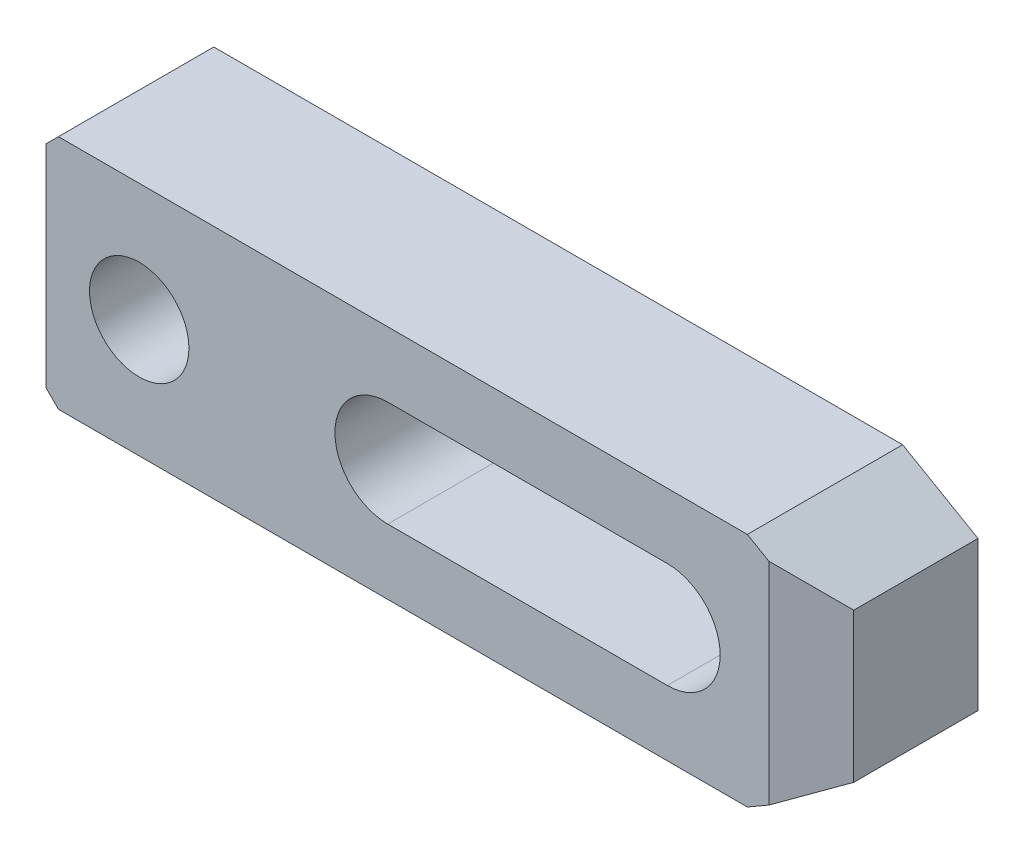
ISO-10303-21;
HEADER;
FILE_DESCRIPTION(('STEP AP214'),'2;1');
FILE_NAME('part.step','',(''),(''),'','','');
FILE_SCHEMA(('AUTOMOTIVE_DESIGN { 1 0 10303 214 1 1 1 1 }'));
ENDSEC;
DATA;
#1=APPLICATION_CONTEXT('core data for automotive mechanical design processes');
#2=APPLICATION_PROTOCOL_DEFINITION('international standard','automotive_design',2000,#1);
#3=PRODUCT_CONTEXT('',#1,'mechanical');
#4=PRODUCT('Part','Part','',(#3));
#5=PRODUCT_RELATED_PRODUCT_CATEGORY('part','',(#4));
#6=PRODUCT_DEFINITION_FORMATION('','',#4);
#7=PRODUCT_DEFINITION_CONTEXT('part definition',#1,'design');
#8=PRODUCT_DEFINITION('design','',#6,#7);
#9=PRODUCT_DEFINITION_SHAPE('','',#8);
#10=(LENGTH_UNIT() NAMED_UNIT(*) SI_UNIT(.MILLI.,.METRE.));
#11=(NAMED_UNIT(*) PLANE_ANGLE_UNIT() SI_UNIT($,.RADIAN.));
#12=(NAMED_UNIT(*) SI_UNIT($,.STERADIAN.) SOLID_ANGLE_UNIT());
#13=UNCERTAINTY_MEASURE_WITH_UNIT(LENGTH_MEASURE(1.E-05),#10,'distance_accuracy_value','');
#14=(GEOMETRIC_REPRESENTATION_CONTEXT(3) GLOBAL_UNCERTAINTY_ASSIGNED_CONTEXT((#13)) GLOBAL_UNIT_ASSIGNED_CONTEXT((#10,
#11,#12)) REPRESENTATION_CONTEXT('',''));
#15=CARTESIAN_POINT('',(0.,0.,0.));
#16=DIRECTION('',(0.,0.,1.));
#17=DIRECTION('',(1.,0.,0.));
#18=AXIS2_PLACEMENT_3D('',#15,#16,#17);
#19=CARTESIAN_POINT('',(-57.4166975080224,59.5833024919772,0.));
#20=DIRECTION('',(0.,0.,1.));
#21=DIRECTION('',(-1.,0.,0.));
#22=AXIS2_PLACEMENT_3D('',#19,#20,#21);
#23=PLANE('',#22);
#24=DIRECTION('',(0.,1.,0.));
#25=VECTOR('',#24,1.);
#26=CARTESIAN_POINT('',(-100.,-17.,0.));
#27=LINE('',#26,#25);
#28=CARTESIAN_POINT('',(-100.,-17.,0.));
#29=VERTEX_POINT('',#28);
#30=CARTESIAN_POINT('',(-100.,-8.5,0.));
#31=VERTEX_POINT('',#30);
#32=EDGE_CURVE('E147',#29,#31,#27,.T.);
#33=ORIENTED_EDGE('',*,*,#32,.T.);
#34=DIRECTION('',(-1.,0.,0.));
#35=VECTOR('',#34,1.);
#36=CARTESIAN_POINT('',(0.,-8.5,0.));
#37=LINE('',#36,#35);
#38=CARTESIAN_POINT('',(0.,-8.5,0.));
#39=VERTEX_POINT('',#38);
#40=EDGE_CURVE('E237',#39,#31,#37,.T.);
#41=ORIENTED_EDGE('',*,*,#40,.F.);
#42=CARTESIAN_POINT('',(0.,0.,0.));
#43=DIRECTION('',(0.,0.,1.));
#44=DIRECTION('',(-1.,0.,0.));
#45=AXIS2_PLACEMENT_3D('',#42,#43,#44);
#46=CIRCLE('',#45,8.5);
#47=CARTESIAN_POINT('',(0.,8.5,0.));
#48=VERTEX_POINT('',#47);
#49=EDGE_CURVE('E128',#39,#48,#46,.T.);
#50=ORIENTED_EDGE('',*,*,#49,.T.);
#51=DIRECTION('',(1.,0.,0.));
#52=VECTOR('',#51,1.);
#53=CARTESIAN_POINT('',(-45.,8.5,0.));
#54=LINE('',#53,#52);
#55=CARTESIAN_POINT('',(-100.,8.5,0.));
#56=VERTEX_POINT('',#55);
#57=EDGE_CURVE('E119',#56,#48,#54,.T.);
#58=ORIENTED_EDGE('',*,*,#57,.F.);
#59=CARTESIAN_POINT('',(-100.,17.,0.));
#60=VERTEX_POINT('',#59);
#61=EDGE_CURVE('E124',#56,#60,#27,.T.);
#62=ORIENTED_EDGE('',*,*,#61,.T.);
#63=DIRECTION('',(-0.707106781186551,-0.707106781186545,0.));
#64=VECTOR('',#63,1.);
#65=CARTESIAN_POINT('',(-98.,19.,0.));
#66=LINE('',#65,#64);
#67=CARTESIAN_POINT('',(-98.,19.,0.));
#68=VERTEX_POINT('',#67);
#69=EDGE_CURVE('E148',#68,#60,#66,.T.);
#70=ORIENTED_EDGE('',*,*,#69,.F.);
#71=DIRECTION('',(-1.,0.,0.));
#72=VECTOR('',#71,1.);
#73=CARTESIAN_POINT('',(12.875644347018,19.,0.));
#74=LINE('',#73,#72);
#75=CARTESIAN_POINT('',(12.875644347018,19.,0.));
#76=VERTEX_POINT('',#75);
#77=EDGE_CURVE('E151',#76,#68,#74,.T.);
#78=ORIENTED_EDGE('',*,*,#77,.F.);
#79=DIRECTION('',(-0.866025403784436,0.5,0.));
#80=VECTOR('',#79,1.);
#81=CARTESIAN_POINT('',(25.,12.,0.));
#82=LINE('',#81,#80);
#83=CARTESIAN_POINT('',(25.,12.,0.));
#84=VERTEX_POINT('',#83);
#85=EDGE_CURVE('E158',#84,#76,#82,.T.);
#86=ORIENTED_EDGE('',*,*,#85,.F.);
#87=DIRECTION('',(0.,-1.,0.));
#88=VECTOR('',#87,1.);
#89=CARTESIAN_POINT('',(25.,12.,0.));
#90=LINE('',#89,#88);
#91=CARTESIAN_POINT('',(25.,-12.,0.));
#92=VERTEX_POINT('',#91);
#93=EDGE_CURVE('E181',#84,#92,#90,.T.);
#94=ORIENTED_EDGE('',*,*,#93,.T.);
#95=DIRECTION('',(-0.86602540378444,-0.5,0.));
#96=VECTOR('',#95,1.);
#97=CARTESIAN_POINT('',(25.,-12.,0.));
#98=LINE('',#97,#96);
#99=CARTESIAN_POINT('',(12.8756443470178,-19.,0.));
#100=VERTEX_POINT('',#99);
#101=EDGE_CURVE('E208',#92,#100,#98,.T.);
#102=ORIENTED_EDGE('',*,*,#101,.T.);
#103=DIRECTION('',(-1.,0.,0.));
#104=VECTOR('',#103,1.);
#105=CARTESIAN_POINT('',(12.8756443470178,-19.,0.));
#106=LINE('',#105,#104);
#107=CARTESIAN_POINT('',(-98.,-19.,0.));
#108=VERTEX_POINT('',#107);
#109=EDGE_CURVE('E210',#100,#108,#106,.T.);
#110=ORIENTED_EDGE('',*,*,#109,.T.);
#111=DIRECTION('',(-0.707106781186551,0.707106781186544,0.));
#112=VECTOR('',#111,1.);
#113=CARTESIAN_POINT('',(-98.,-19.,0.));
#114=LINE('',#113,#112);
#115=EDGE_CURVE('E150',#108,#29,#114,.T.);
#116=ORIENTED_EDGE('',*,*,#115,.T.);
#117=EDGE_LOOP('',(#33,#41,#50,#58,#62,#70,#78,#86,#94,#102,#110,#116));
#118=FACE_BOUND('',#117,.T.);
#119=ADVANCED_FACE('F14',(#118),#23,.F.);
#120=CARTESIAN_POINT('',(-100.,-17.,25.));
#121=DIRECTION('',(-1.,0.,0.));
#122=DIRECTION('',(0.,0.,-1.));
#123=AXIS2_PLACEMENT_3D('',#120,#121,#122);
#124=PLANE('',#123);
#125=DIRECTION('',(0.,-1.,0.));
#126=VECTOR('',#125,1.);
#127=CARTESIAN_POINT('',(-100.,-17.,5.));
#128=LINE('',#127,#126);
#129=CARTESIAN_POINT('',(-100.,8.5,5.));
#130=VERTEX_POINT('',#129);
#131=CARTESIAN_POINT('',(-100.,-8.5,5.));
#132=VERTEX_POINT('',#131);
#133=EDGE_CURVE('E141',#130,#132,#128,.T.);
#134=ORIENTED_EDGE('',*,*,#133,.T.);
#135=DIRECTION('',(0.,0.,-1.));
#136=VECTOR('',#135,1.);
#137=CARTESIAN_POINT('',(-100.,-8.5,25.));
#138=LINE('',#137,#136);
#139=EDGE_CURVE('E140',#132,#31,#138,.T.);
#140=ORIENTED_EDGE('',*,*,#139,.T.);
#141=ORIENTED_EDGE('',*,*,#32,.F.);
#142=DIRECTION('',(0.,0.,-1.));
#143=VECTOR('',#142,1.);
#144=CARTESIAN_POINT('',(-100.,-17.,25.));
#145=LINE('',#144,#143);
#146=CARTESIAN_POINT('',(-100.,-17.,25.));
#147=VERTEX_POINT('',#146);
#148=EDGE_CURVE('E189',#147,#29,#145,.T.);
#149=ORIENTED_EDGE('',*,*,#148,.F.);
#150=DIRECTION('',(0.,1.,0.));
#151=VECTOR('',#150,1.);
#152=CARTESIAN_POINT('',(-100.,-17.,25.));
#153=LINE('',#152,#151);
#154=CARTESIAN_POINT('',(-100.,17.,25.));
#155=VERTEX_POINT('',#154);
#156=EDGE_CURVE('E171',#147,#155,#153,.T.);
#157=ORIENTED_EDGE('',*,*,#156,.T.);
#158=DIRECTION('',(0.,0.,-1.));
#159=VECTOR('',#158,1.);
#160=CARTESIAN_POINT('',(-100.,17.,25.));
#161=LINE('',#160,#159);
#162=EDGE_CURVE('E145',#155,#60,#161,.T.);
#163=ORIENTED_EDGE('',*,*,#162,.T.);
#164=ORIENTED_EDGE('',*,*,#61,.F.);
#165=DIRECTION('',(0.,0.,-1.));
#166=VECTOR('',#165,1.);
#167=CARTESIAN_POINT('',(-100.,8.5,25.));
#168=LINE('',#167,#166);
#169=EDGE_CURVE('E135',#130,#56,#168,.T.);
#170=ORIENTED_EDGE('',*,*,#169,.F.);
#171=EDGE_LOOP('',(#134,#140,#141,#149,#157,#163,#164,#170));
#172=FACE_BOUND('',#171,.T.);
#173=ADVANCED_FACE('F143',(#172),#124,.T.);
#174=CARTESIAN_POINT('',(-85.,0.,25.));
#175=DIRECTION('',(0.,0.,-1.));
#176=DIRECTION('',(1.,0.,0.));
#177=AXIS2_PLACEMENT_3D('',#174,#175,#176);
#178=CYLINDRICAL_SURFACE('',#177,8.);
#179=CARTESIAN_POINT('',(-85.,0.,25.));
#180=DIRECTION('',(0.,0.,1.));
#181=DIRECTION('',(-1.,0.,0.));
#182=AXIS2_PLACEMENT_3D('',#179,#180,#181);
#183=CIRCLE('',#182,8.);
#184=CARTESIAN_POINT('',(-93.,0.,25.));
#185=VERTEX_POINT('',#184);
#186=EDGE_CURVE('E161',#185,#185,#183,.T.);
#187=ORIENTED_EDGE('',*,*,#186,.T.);
#188=EDGE_LOOP('',(#187));
#189=FACE_BOUND('',#188,.T.);
#190=CARTESIAN_POINT('',(-85.,0.,5.));
#191=DIRECTION('',(0.,0.,-1.));
#192=DIRECTION('',(1.,0.,0.));
#193=AXIS2_PLACEMENT_3D('',#190,#191,#192);
#194=CIRCLE('',#193,8.);
#195=CARTESIAN_POINT('',(-77.,0.,5.));
#196=VERTEX_POINT('',#195);
#197=EDGE_CURVE('E425',#196,#196,#194,.T.);
#198=ORIENTED_EDGE('',*,*,#197,.T.);
#199=EDGE_LOOP('',(#198));
#200=FACE_BOUND('',#199,.T.);
#201=ADVANCED_FACE('F262',(#189,#200),#178,.F.);
#202=CARTESIAN_POINT('',(-45.,0.,25.));
#203=DIRECTION('',(0.,0.,-1.));
#204=DIRECTION('',(1.,0.,0.));
#205=AXIS2_PLACEMENT_3D('',#202,#203,#204);
#206=CYLINDRICAL_SURFACE('',#205,8.5);
#207=DIRECTION('',(0.,0.,-1.));
#208=VECTOR('',#207,1.);
#209=CARTESIAN_POINT('',(-45.,-8.5,25.));
#210=LINE('',#209,#208);
#211=CARTESIAN_POINT('',(-45.,-8.5,25.));
#212=VERTEX_POINT('',#211);
#213=CARTESIAN_POINT('',(-45.,-8.5,5.));
#214=VERTEX_POINT('',#213);
#215=EDGE_CURVE('E256',#212,#214,#210,.T.);
#216=ORIENTED_EDGE('',*,*,#215,.T.);
#217=CARTESIAN_POINT('',(-45.,0.,5.));
#218=DIRECTION('',(0.,0.,-1.));
#219=DIRECTION('',(1.,0.,0.));
#220=AXIS2_PLACEMENT_3D('',#217,#218,#219);
#221=CIRCLE('',#220,8.5);
#222=CARTESIAN_POINT('',(-45.,8.5,5.));
#223=VERTEX_POINT('',#222);
#224=EDGE_CURVE('E278',#214,#223,#221,.T.);
#225=ORIENTED_EDGE('',*,*,#224,.T.);
#226=DIRECTION('',(0.,0.,-1.));
#227=VECTOR('',#226,1.);
#228=CARTESIAN_POINT('',(-45.,8.5,25.));
#229=LINE('',#228,#227);
#230=CARTESIAN_POINT('',(-45.,8.5,25.));
#231=VERTEX_POINT('',#230);
#232=EDGE_CURVE('E244',#231,#223,#229,.T.);
#233=ORIENTED_EDGE('',*,*,#232,.F.);
#234=CARTESIAN_POINT('',(-45.,0.,25.));
#235=DIRECTION('',(0.,0.,1.));
#236=DIRECTION('',(-1.,0.,0.));
#237=AXIS2_PLACEMENT_3D('',#234,#235,#236);
#238=CIRCLE('',#237,8.5);
#239=EDGE_CURVE('E132',#231,#212,#238,.T.);
#240=ORIENTED_EDGE('',*,*,#239,.T.);
#241=EDGE_LOOP('',(#216,#225,#233,#240));
#242=FACE_BOUND('',#241,.T.);
#243=ADVANCED_FACE('F269',(#242),#206,.F.);
#244=CARTESIAN_POINT('',(-57.4166975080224,59.5833024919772,25.));
#245=DIRECTION('',(0.,0.,1.));
#246=DIRECTION('',(-1.,0.,0.));
#247=AXIS2_PLACEMENT_3D('',#244,#245,#246);
#248=PLANE('',#247);
#249=DIRECTION('',(0.,-1.,0.));
#250=VECTOR('',#249,1.);
#251=CARTESIAN_POINT('',(16.3397459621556,59.5833024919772,25.));
#252=LINE('',#251,#250);
#253=CARTESIAN_POINT('',(16.3397459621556,17.,25.));
#254=VERTEX_POINT('',#253);
#255=CARTESIAN_POINT('',(16.3397459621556,-17.,25.));
#256=VERTEX_POINT('',#255);
#257=EDGE_CURVE('E233',#254,#256,#252,.T.);
#258=ORIENTED_EDGE('',*,*,#257,.F.);
#259=DIRECTION('',(-0.866025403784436,0.5,0.));
#260=VECTOR('',#259,1.);
#261=CARTESIAN_POINT('',(25.,12.,25.));
#262=LINE('',#261,#260);
#263=CARTESIAN_POINT('',(12.875644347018,19.,25.));
#264=VERTEX_POINT('',#263);
#265=EDGE_CURVE('E179',#254,#264,#262,.T.);
#266=ORIENTED_EDGE('',*,*,#265,.T.);
#267=DIRECTION('',(-1.,0.,0.));
#268=VECTOR('',#267,1.);
#269=CARTESIAN_POINT('',(12.875644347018,19.,25.));
#270=LINE('',#269,#268);
#271=CARTESIAN_POINT('',(-98.,19.,25.));
#272=VERTEX_POINT('',#271);
#273=EDGE_CURVE('E176',#264,#272,#270,.T.);
#274=ORIENTED_EDGE('',*,*,#273,.T.);
#275=DIRECTION('',(-0.707106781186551,-0.707106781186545,0.));
#276=VECTOR('',#275,1.);
#277=CARTESIAN_POINT('',(-98.,19.,25.));
#278=LINE('',#277,#276);
#279=EDGE_CURVE('E173',#272,#155,#278,.T.);
#280=ORIENTED_EDGE('',*,*,#279,.T.);
#281=ORIENTED_EDGE('',*,*,#156,.F.);
#282=DIRECTION('',(-0.707106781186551,0.707106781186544,0.));
#283=VECTOR('',#282,1.);
#284=CARTESIAN_POINT('',(-98.,-19.,25.));
#285=LINE('',#284,#283);
#286=CARTESIAN_POINT('',(-98.,-19.,25.));
#287=VERTEX_POINT('',#286);
#288=EDGE_CURVE('E168',#287,#147,#285,.T.);
#289=ORIENTED_EDGE('',*,*,#288,.F.);
#290=DIRECTION('',(-1.,0.,0.));
#291=VECTOR('',#290,1.);
#292=CARTESIAN_POINT('',(12.8756443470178,-19.,25.));
#293=LINE('',#292,#291);
#294=CARTESIAN_POINT('',(12.8756443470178,-19.,25.));
#295=VERTEX_POINT('',#294);
#296=EDGE_CURVE('E165',#295,#287,#293,.T.);
#297=ORIENTED_EDGE('',*,*,#296,.F.);
#298=DIRECTION('',(-0.86602540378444,-0.5,0.));
#299=VECTOR('',#298,1.);
#300=CARTESIAN_POINT('',(25.,-12.,25.));
#301=LINE('',#300,#299);
#302=EDGE_CURVE('E162',#256,#295,#301,.T.);
#303=ORIENTED_EDGE('',*,*,#302,.F.);
#304=EDGE_LOOP('',(#258,#266,#274,#280,#281,#289,#297,#303));
#305=FACE_BOUND('',#304,.T.);
#306=ORIENTED_EDGE('',*,*,#186,.F.);
#307=EDGE_LOOP('',(#306));
#308=FACE_BOUND('',#307,.T.);
#309=DIRECTION('',(-1.,0.,0.));
#310=VECTOR('',#309,1.);
#311=CARTESIAN_POINT('',(0.,-8.5,25.));
#312=LINE('',#311,#310);
#313=CARTESIAN_POINT('',(0.,-8.5,25.));
#314=VERTEX_POINT('',#313);
#315=EDGE_CURVE('E247',#314,#212,#312,.T.);
#316=ORIENTED_EDGE('',*,*,#315,.T.);
#317=ORIENTED_EDGE('',*,*,#239,.F.);
#318=DIRECTION('',(1.,0.,0.));
#319=VECTOR('',#318,1.);
#320=CARTESIAN_POINT('',(-45.,8.5,25.));
#321=LINE('',#320,#319);
#322=CARTESIAN_POINT('',(0.,8.5,25.));
#323=VERTEX_POINT('',#322);
#324=EDGE_CURVE('E241',#231,#323,#321,.T.);
#325=ORIENTED_EDGE('',*,*,#324,.T.);
#326=CARTESIAN_POINT('',(0.,0.,25.));
#327=DIRECTION('',(0.,0.,1.));
#328=DIRECTION('',(-1.,0.,0.));
#329=AXIS2_PLACEMENT_3D('',#326,#327,#328);
#330=CIRCLE('',#329,8.5);
#331=EDGE_CURVE('E245',#314,#323,#330,.T.);
#332=ORIENTED_EDGE('',*,*,#331,.F.);
#333=EDGE_LOOP('',(#316,#317,#325,#332));
#334=FACE_BOUND('',#333,.T.);
#335=ADVANCED_FACE('F265',(#305,#308,#334),#248,.T.);
#336=CARTESIAN_POINT('',(25.,12.,25.));
#337=DIRECTION('',(-0.5,-0.866025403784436,0.));
#338=DIRECTION('',(0.866025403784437,-0.5,0.));
#339=AXIS2_PLACEMENT_3D('',#336,#337,#338);
#340=PLANE('',#339);
#341=ORIENTED_EDGE('',*,*,#265,.F.);
#342=DIRECTION('',(0.774596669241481,-0.447213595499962,-0.447213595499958));
#343=VECTOR('',#342,1.);
#344=CARTESIAN_POINT('',(23.2679491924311,13.,21.));
#345=LINE('',#344,#343);
#346=CARTESIAN_POINT('',(25.,12.,20.));
#347=VERTEX_POINT('',#346);
#348=EDGE_CURVE('E235',#254,#347,#345,.T.);
#349=ORIENTED_EDGE('',*,*,#348,.T.);
#350=DIRECTION('',(0.,0.,-1.));
#351=VECTOR('',#350,1.);
#352=CARTESIAN_POINT('',(25.,12.,25.));
#353=LINE('',#352,#351);
#354=EDGE_CURVE('E164',#347,#84,#353,.T.);
#355=ORIENTED_EDGE('',*,*,#354,.T.);
#356=ORIENTED_EDGE('',*,*,#85,.T.);
#357=DIRECTION('',(0.,0.,-1.));
#358=VECTOR('',#357,1.);
#359=CARTESIAN_POINT('',(12.875644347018,19.,25.));
#360=LINE('',#359,#358);
#361=EDGE_CURVE('E9',#264,#76,#360,.T.);
#362=ORIENTED_EDGE('',*,*,#361,.F.);
#363=EDGE_LOOP('',(#341,#349,#355,#356,#362));
#364=FACE_BOUND('',#363,.T.);
#365=ADVANCED_FACE('F268',(#364),#340,.F.);
#366=CARTESIAN_POINT('',(12.875644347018,19.,25.));
#367=DIRECTION('',(0.,-1.,0.));
#368=DIRECTION('',(0.,0.,1.));
#369=AXIS2_PLACEMENT_3D('',#366,#367,#368);
#370=PLANE('',#369);
#371=DIRECTION('',(0.,0.,-1.));
#372=VECTOR('',#371,1.);
#373=CARTESIAN_POINT('',(-98.,19.,25.));
#374=LINE('',#373,#372);
#375=EDGE_CURVE('E22',#272,#68,#374,.T.);
#376=ORIENTED_EDGE('',*,*,#375,.F.);
#377=ORIENTED_EDGE('',*,*,#273,.F.);
#378=ORIENTED_EDGE('',*,*,#361,.T.);
#379=ORIENTED_EDGE('',*,*,#77,.T.);
#380=EDGE_LOOP('',(#376,#377,#378,#379));
#381=FACE_BOUND('',#380,.T.);
#382=ADVANCED_FACE('F16',(#381),#370,.F.);
#383=CARTESIAN_POINT('',(-98.,19.,25.));
#384=DIRECTION('',(0.707106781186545,-0.707106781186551,0.));
#385=DIRECTION('',(0.707106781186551,0.707106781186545,0.));
#386=AXIS2_PLACEMENT_3D('',#383,#384,#385);
#387=PLANE('',#386);
#388=ORIENTED_EDGE('',*,*,#162,.F.);
#389=ORIENTED_EDGE('',*,*,#279,.F.);
#390=ORIENTED_EDGE('',*,*,#375,.T.);
#391=ORIENTED_EDGE('',*,*,#69,.T.);
#392=EDGE_LOOP('',(#388,#389,#390,#391));
#393=FACE_BOUND('',#392,.T.);
#394=ADVANCED_FACE('F193',(#393),#387,.F.);
#395=CARTESIAN_POINT('',(-98.,-19.,25.));
#396=DIRECTION('',(-0.707106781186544,-0.707106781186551,0.));
#397=DIRECTION('',(0.707106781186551,-0.707106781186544,0.));
#398=AXIS2_PLACEMENT_3D('',#395,#396,#397);
#399=PLANE('',#398);
#400=DIRECTION('',(0.,0.,-1.));
#401=VECTOR('',#400,1.);
#402=CARTESIAN_POINT('',(-98.,-19.,25.));
#403=LINE('',#402,#401);
#404=EDGE_CURVE('E187',#287,#108,#403,.T.);
#405=ORIENTED_EDGE('',*,*,#404,.F.);
#406=ORIENTED_EDGE('',*,*,#288,.T.);
#407=ORIENTED_EDGE('',*,*,#148,.T.);
#408=ORIENTED_EDGE('',*,*,#115,.F.);
#409=EDGE_LOOP('',(#405,#406,#407,#408));
#410=FACE_BOUND('',#409,.T.);
#411=ADVANCED_FACE('F220',(#410),#399,.T.);
#412=CARTESIAN_POINT('',(12.8756443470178,-19.,25.));
#413=DIRECTION('',(0.,-1.,0.));
#414=DIRECTION('',(0.,0.,1.));
#415=AXIS2_PLACEMENT_3D('',#412,#413,#414);
#416=PLANE('',#415);
#417=DIRECTION('',(0.,0.,-1.));
#418=VECTOR('',#417,1.);
#419=CARTESIAN_POINT('',(12.8756443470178,-19.,25.));
#420=LINE('',#419,#418);
#421=EDGE_CURVE('E185',#295,#100,#420,.T.);
#422=ORIENTED_EDGE('',*,*,#421,.F.);
#423=ORIENTED_EDGE('',*,*,#296,.T.);
#424=ORIENTED_EDGE('',*,*,#404,.T.);
#425=ORIENTED_EDGE('',*,*,#109,.F.);
#426=EDGE_LOOP('',(#422,#423,#424,#425));
#427=FACE_BOUND('',#426,.T.);
#428=ADVANCED_FACE('F306',(#427),#416,.T.);
#429=CARTESIAN_POINT('',(25.,-12.,25.));
#430=DIRECTION('',(0.5,-0.86602540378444,0.));
#431=DIRECTION('',(0.86602540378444,0.5,0.));
#432=AXIS2_PLACEMENT_3D('',#429,#430,#431);
#433=PLANE('',#432);
#434=DIRECTION('',(0.774596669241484,0.447213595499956,-0.44721359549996));
#435=VECTOR('',#434,1.);
#436=CARTESIAN_POINT('',(23.2679491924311,-13.,21.));
#437=LINE('',#436,#435);
#438=CARTESIAN_POINT('',(25.,-12.,20.));
#439=VERTEX_POINT('',#438);
#440=EDGE_CURVE('E37',#256,#439,#437,.T.);
#441=ORIENTED_EDGE('',*,*,#440,.F.);
#442=ORIENTED_EDGE('',*,*,#302,.T.);
#443=ORIENTED_EDGE('',*,*,#421,.T.);
#444=ORIENTED_EDGE('',*,*,#101,.F.);
#445=DIRECTION('',(0.,0.,-1.));
#446=VECTOR('',#445,1.);
#447=CARTESIAN_POINT('',(25.,-12.,25.));
#448=LINE('',#447,#446);
#449=EDGE_CURVE('E183',#439,#92,#448,.T.);
#450=ORIENTED_EDGE('',*,*,#449,.F.);
#451=EDGE_LOOP('',(#441,#442,#443,#444,#450));
#452=FACE_BOUND('',#451,.T.);
#453=ADVANCED_FACE('F303',(#452),#433,.T.);
#454=CARTESIAN_POINT('',(25.,12.,25.));
#455=DIRECTION('',(1.,0.,0.));
#456=DIRECTION('',(0.,0.,1.));
#457=AXIS2_PLACEMENT_3D('',#454,#455,#456);
#458=PLANE('',#457);
#459=DIRECTION('',(0.,-1.,0.));
#460=VECTOR('',#459,1.);
#461=CARTESIAN_POINT('',(25.,20.,20.));
#462=LINE('',#461,#460);
#463=EDGE_CURVE('E227',#347,#439,#462,.T.);
#464=ORIENTED_EDGE('',*,*,#463,.T.);
#465=ORIENTED_EDGE('',*,*,#449,.T.);
#466=ORIENTED_EDGE('',*,*,#93,.F.);
#467=ORIENTED_EDGE('',*,*,#354,.F.);
#468=EDGE_LOOP('',(#464,#465,#466,#467));
#469=FACE_BOUND('',#468,.T.);
#470=ADVANCED_FACE('F205',(#469),#458,.T.);
#471=CARTESIAN_POINT('',(0.,-8.5,25.));
#472=DIRECTION('',(0.,-1.,0.));
#473=DIRECTION('',(1.,0.,0.));
#474=AXIS2_PLACEMENT_3D('',#471,#472,#473);
#475=PLANE('',#474);
#476=ORIENTED_EDGE('',*,*,#40,.T.);
#477=ORIENTED_EDGE('',*,*,#139,.F.);
#478=DIRECTION('',(1.,0.,0.));
#479=VECTOR('',#478,1.);
#480=CARTESIAN_POINT('',(-105.,-8.5,5.));
#481=LINE('',#480,#479);
#482=EDGE_CURVE('E276',#132,#214,#481,.T.);
#483=ORIENTED_EDGE('',*,*,#482,.T.);
#484=ORIENTED_EDGE('',*,*,#215,.F.);
#485=ORIENTED_EDGE('',*,*,#315,.F.);
#486=DIRECTION('',(0.,0.,-1.));
#487=VECTOR('',#486,1.);
#488=CARTESIAN_POINT('',(0.,-8.5,25.));
#489=LINE('',#488,#487);
#490=EDGE_CURVE('E255',#314,#39,#489,.T.);
#491=ORIENTED_EDGE('',*,*,#490,.T.);
#492=EDGE_LOOP('',(#476,#477,#483,#484,#485,#491));
#493=FACE_BOUND('',#492,.T.);
#494=ADVANCED_FACE('F275',(#493),#475,.F.);
#495=CARTESIAN_POINT('',(0.,0.,25.));
#496=DIRECTION('',(0.,0.,-1.));
#497=DIRECTION('',(1.,0.,0.));
#498=AXIS2_PLACEMENT_3D('',#495,#496,#497);
#499=CYLINDRICAL_SURFACE('',#498,8.5);
#500=DIRECTION('',(0.,0.,-1.));
#501=VECTOR('',#500,1.);
#502=CARTESIAN_POINT('',(0.,8.5,25.));
#503=LINE('',#502,#501);
#504=EDGE_CURVE('E253',#323,#48,#503,.T.);
#505=ORIENTED_EDGE('',*,*,#504,.T.);
#506=ORIENTED_EDGE('',*,*,#49,.F.);
#507=ORIENTED_EDGE('',*,*,#490,.F.);
#508=ORIENTED_EDGE('',*,*,#331,.T.);
#509=EDGE_LOOP('',(#505,#506,#507,#508));
#510=FACE_BOUND('',#509,.T.);
#511=ADVANCED_FACE('F280',(#510),#499,.F.);
#512=CARTESIAN_POINT('',(-45.,8.5,25.));
#513=DIRECTION('',(0.,1.,0.));
#514=DIRECTION('',(-1.,0.,0.));
#515=AXIS2_PLACEMENT_3D('',#512,#513,#514);
#516=PLANE('',#515);
#517=ORIENTED_EDGE('',*,*,#57,.T.);
#518=ORIENTED_EDGE('',*,*,#504,.F.);
#519=ORIENTED_EDGE('',*,*,#324,.F.);
#520=ORIENTED_EDGE('',*,*,#232,.T.);
#521=DIRECTION('',(1.,0.,0.));
#522=VECTOR('',#521,1.);
#523=CARTESIAN_POINT('',(-105.,8.5,5.));
#524=LINE('',#523,#522);
#525=EDGE_CURVE('E29',#130,#223,#524,.T.);
#526=ORIENTED_EDGE('',*,*,#525,.F.);
#527=ORIENTED_EDGE('',*,*,#169,.T.);
#528=EDGE_LOOP('',(#517,#518,#519,#520,#526,#527));
#529=FACE_BOUND('',#528,.T.);
#530=ADVANCED_FACE('F136',(#529),#516,.F.);
#531=CARTESIAN_POINT('',(12.875644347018,20.,27.));
#532=DIRECTION('',(-0.5,0.,-0.866025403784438));
#533=DIRECTION('',(0.866025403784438,0.,-0.5));
#534=AXIS2_PLACEMENT_3D('',#531,#532,#533);
#535=PLANE('',#534);
#536=ORIENTED_EDGE('',*,*,#257,.T.);
#537=ORIENTED_EDGE('',*,*,#440,.T.);
#538=ORIENTED_EDGE('',*,*,#463,.F.);
#539=ORIENTED_EDGE('',*,*,#348,.F.);
#540=EDGE_LOOP('',(#536,#537,#538,#539));
#541=FACE_BOUND('',#540,.T.);
#542=ADVANCED_FACE('F288',(#541),#535,.F.);
#543=CARTESIAN_POINT('',(-105.,-8.5,5.));
#544=DIRECTION('',(0.,0.,-1.));
#545=DIRECTION('',(1.,0.,0.));
#546=AXIS2_PLACEMENT_3D('',#543,#544,#545);
#547=PLANE('',#546);
#548=ORIENTED_EDGE('',*,*,#197,.F.);
#549=EDGE_LOOP('',(#548));
#550=FACE_BOUND('',#549,.T.);
#551=ORIENTED_EDGE('',*,*,#525,.T.);
#552=ORIENTED_EDGE('',*,*,#224,.F.);
#553=ORIENTED_EDGE('',*,*,#482,.F.);
#554=ORIENTED_EDGE('',*,*,#133,.F.);
#555=EDGE_LOOP('',(#551,#552,#553,#554));
#556=FACE_BOUND('',#555,.T.);
#557=ADVANCED_FACE('F410',(#550,#556),#547,.T.);
#558=CLOSED_SHELL('',(#119,#173,#201,#243,#335,#365,#382,#394,#411,#428,#453,#470,#494,#511,
#530,#542,#557));
#559=MANIFOLD_SOLID_BREP('B1',#558);
#560=ADVANCED_BREP_SHAPE_REPRESENTATION('',(#18,#559),#14);
#561=SHAPE_DEFINITION_REPRESENTATION(#9,#560);
ENDSEC;
END-ISO-10303-21;
